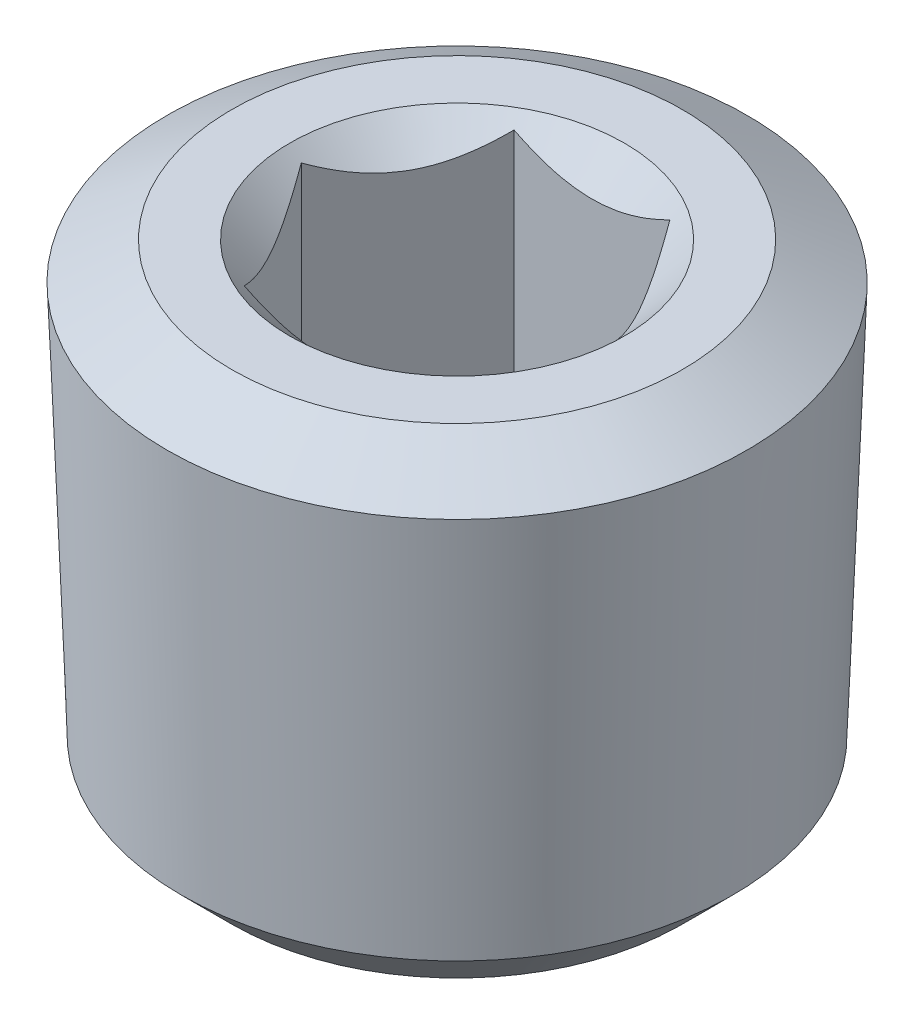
ISO-10303-21;
HEADER;
FILE_DESCRIPTION(('STEP AP214'),'2;1');
FILE_NAME('part.step','',(''),(''),'','','');
FILE_SCHEMA(('AUTOMOTIVE_DESIGN { 1 0 10303 214 1 1 1 1 }'));
ENDSEC;
DATA;
#1=APPLICATION_CONTEXT('core data for automotive mechanical design processes');
#2=APPLICATION_PROTOCOL_DEFINITION('international standard','automotive_design',2000,#1);
#3=PRODUCT_CONTEXT('',#1,'mechanical');
#4=PRODUCT('Part','Part','',(#3));
#5=PRODUCT_RELATED_PRODUCT_CATEGORY('part','',(#4));
#6=PRODUCT_DEFINITION_FORMATION('','',#4);
#7=PRODUCT_DEFINITION_CONTEXT('part definition',#1,'design');
#8=PRODUCT_DEFINITION('design','',#6,#7);
#9=PRODUCT_DEFINITION_SHAPE('','',#8);
#10=(LENGTH_UNIT() NAMED_UNIT(*) SI_UNIT(.MILLI.,.METRE.));
#11=(NAMED_UNIT(*) PLANE_ANGLE_UNIT() SI_UNIT($,.RADIAN.));
#12=(NAMED_UNIT(*) SI_UNIT($,.STERADIAN.) SOLID_ANGLE_UNIT());
#13=UNCERTAINTY_MEASURE_WITH_UNIT(LENGTH_MEASURE(1.E-05),#10,'distance_accuracy_value','');
#14=(GEOMETRIC_REPRESENTATION_CONTEXT(3) GLOBAL_UNCERTAINTY_ASSIGNED_CONTEXT((#13)) GLOBAL_UNIT_ASSIGNED_CONTEXT((#10,
#11,#12)) REPRESENTATION_CONTEXT('',''));
#15=CARTESIAN_POINT('',(0.,0.,0.));
#16=DIRECTION('',(0.,0.,1.));
#17=DIRECTION('',(1.,0.,0.));
#18=AXIS2_PLACEMENT_3D('',#15,#16,#17);
#19=CARTESIAN_POINT('',(0.,0.,0.));
#20=DIRECTION('',(0.,1.,0.));
#21=DIRECTION('',(0.,0.,1.));
#22=AXIS2_PLACEMENT_3D('',#19,#20,#21);
#23=PLANE('',#22);
#24=CARTESIAN_POINT('',(0.,0.,0.));
#25=DIRECTION('',(0.,1.,0.));
#26=DIRECTION('',(0.,0.,1.));
#27=AXIS2_PLACEMENT_3D('',#24,#25,#26);
#28=CIRCLE('',#27,3.937);
#29=CARTESIAN_POINT('',(0.,0.,3.937));
#30=VERTEX_POINT('',#29);
#31=EDGE_CURVE('E247',#30,#30,#28,.T.);
#32=ORIENTED_EDGE('',*,*,#31,.F.);
#33=EDGE_LOOP('',(#32));
#34=FACE_BOUND('',#33,.T.);
#35=CARTESIAN_POINT('',(0.,0.,0.));
#36=DIRECTION('',(0.,1.,0.));
#37=DIRECTION('',(0.,0.,1.));
#38=AXIS2_PLACEMENT_3D('',#35,#36,#37);
#39=CIRCLE('',#38,5.30290826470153);
#40=CARTESIAN_POINT('',(0.,0.,5.30290826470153));
#41=VERTEX_POINT('',#40);
#42=EDGE_CURVE('E12',#41,#41,#39,.T.);
#43=ORIENTED_EDGE('',*,*,#42,.T.);
#44=EDGE_LOOP('',(#43));
#45=FACE_BOUND('',#44,.T.);
#46=ADVANCED_FACE('F34',(#34,#45),#23,.T.);
#47=CARTESIAN_POINT('',(0.,0.,0.));
#48=DIRECTION('',(0.,-1.,0.));
#49=DIRECTION('',(0.,0.,-1.));
#50=AXIS2_PLACEMENT_3D('',#47,#48,#49);
#51=CONICAL_SURFACE('',#50,5.30290826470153,1.0471975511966);
#52=CARTESIAN_POINT('',(0.,-0.879323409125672,0.));
#53=DIRECTION('',(0.,1.,0.));
#54=DIRECTION('',(0.,0.,1.));
#55=AXIS2_PLACEMENT_3D('',#52,#53,#54);
#56=CIRCLE('',#55,6.82594108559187);
#57=CARTESIAN_POINT('',(0.,-0.879323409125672,6.82594108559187));
#58=VERTEX_POINT('',#57);
#59=EDGE_CURVE('E41',#58,#58,#56,.T.);
#60=ORIENTED_EDGE('',*,*,#59,.T.);
#61=EDGE_LOOP('',(#60));
#62=FACE_BOUND('',#61,.T.);
#63=ORIENTED_EDGE('',*,*,#42,.F.);
#64=EDGE_LOOP('',(#63));
#65=FACE_BOUND('',#64,.T.);
#66=ADVANCED_FACE('F237',(#62,#65),#51,.T.);
#67=CARTESIAN_POINT('',(0.,-0.879323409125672,0.));
#68=DIRECTION('',(0.,1.,0.));
#69=DIRECTION('',(0.,0.,1.));
#70=AXIS2_PLACEMENT_3D('',#67,#68,#69);
#71=CONICAL_SURFACE('',#70,6.82594108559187,0.0364424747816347);
#72=CARTESIAN_POINT('',(0.,-10.1167510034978,0.));
#73=DIRECTION('',(0.,1.,0.));
#74=DIRECTION('',(0.,0.,1.));
#75=AXIS2_PLACEMENT_3D('',#72,#73,#74);
#76=CIRCLE('',#75,6.48915726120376);
#77=CARTESIAN_POINT('',(0.,-10.1167510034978,6.48915726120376));
#78=VERTEX_POINT('',#77);
#79=EDGE_CURVE('E255',#78,#78,#76,.T.);
#80=ORIENTED_EDGE('',*,*,#79,.T.);
#81=EDGE_LOOP('',(#80));
#82=FACE_BOUND('',#81,.T.);
#83=ORIENTED_EDGE('',*,*,#59,.F.);
#84=EDGE_LOOP('',(#83));
#85=FACE_BOUND('',#84,.T.);
#86=ADVANCED_FACE('F242',(#82,#85),#71,.T.);
#87=CARTESIAN_POINT('',(0.,-10.1167510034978,0.));
#88=DIRECTION('',(0.,1.,0.));
#89=DIRECTION('',(0.,0.,1.));
#90=AXIS2_PLACEMENT_3D('',#87,#88,#89);
#91=CONICAL_SURFACE('',#90,6.48915726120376,0.785398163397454);
#92=CARTESIAN_POINT('',(0.,-11.303,0.));
#93=DIRECTION('',(0.,1.,0.));
#94=DIRECTION('',(0.,0.,1.));
#95=AXIS2_PLACEMENT_3D('',#92,#93,#94);
#96=CIRCLE('',#95,5.30290826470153);
#97=CARTESIAN_POINT('',(0.,-11.303,5.30290826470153));
#98=VERTEX_POINT('',#97);
#99=EDGE_CURVE('E251',#98,#98,#96,.T.);
#100=ORIENTED_EDGE('',*,*,#99,.T.);
#101=EDGE_LOOP('',(#100));
#102=FACE_BOUND('',#101,.T.);
#103=ORIENTED_EDGE('',*,*,#79,.F.);
#104=EDGE_LOOP('',(#103));
#105=FACE_BOUND('',#104,.T.);
#106=ADVANCED_FACE('F265',(#102,#105),#91,.T.);
#107=CARTESIAN_POINT('',(-5.30290826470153,-11.303,0.));
#108=DIRECTION('',(0.,-1.,0.));
#109=DIRECTION('',(0.,0.,-1.));
#110=AXIS2_PLACEMENT_3D('',#107,#108,#109);
#111=PLANE('',#110);
#112=ORIENTED_EDGE('',*,*,#99,.F.);
#113=EDGE_LOOP('',(#112));
#114=FACE_BOUND('',#113,.T.);
#115=ADVANCED_FACE('F181',(#114),#111,.T.);
#116=CARTESIAN_POINT('',(0.,0.,0.));
#117=DIRECTION('',(0.,1.,0.));
#118=DIRECTION('',(0.,0.,1.));
#119=AXIS2_PLACEMENT_3D('',#116,#117,#118);
#120=CONICAL_SURFACE('',#119,3.937,0.785398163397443);
#121=CARTESIAN_POINT('',(-3.93571910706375,1.11972916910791,3.175));
#122=CARTESIAN_POINT('',(-3.84104338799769,1.04605819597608,3.175));
#123=CARTESIAN_POINT('',(-3.7458702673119,0.973016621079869,3.175));
#124=CARTESIAN_POINT('',(-3.55432152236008,0.828483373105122,3.175));
#125=CARTESIAN_POINT('',(-3.45794562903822,0.756992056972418,3.175));
#126=CARTESIAN_POINT('',(-3.26308115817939,0.615342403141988,3.175));
#127=CARTESIAN_POINT('',(-3.1645820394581,0.54519852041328,3.175));
#128=CARTESIAN_POINT('',(-2.96596703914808,0.407246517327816,3.175));
#129=CARTESIAN_POINT('',(-2.86585126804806,0.339438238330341,3.175));
#130=CARTESIAN_POINT('',(-2.6568963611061,0.20221469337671,3.175));
#131=CARTESIAN_POINT('',(-2.5479247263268,0.133000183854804,3.175));
#132=CARTESIAN_POINT('',(-2.32741654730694,-0.00128644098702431,3.175));
#133=CARTESIAN_POINT('',(-2.21587956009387,-0.0663578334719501,3.175));
#134=CARTESIAN_POINT('',(-1.99018437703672,-0.190984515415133,3.175));
#135=CARTESIAN_POINT('',(-1.87603517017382,-0.250555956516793,3.175));
#136=CARTESIAN_POINT('',(-1.64444175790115,-0.362847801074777,3.175));
#137=CARTESIAN_POINT('',(-1.52699917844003,-0.415571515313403,3.175));
#138=CARTESIAN_POINT('',(-1.30155237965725,-0.506949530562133,3.175));
#139=CARTESIAN_POINT('',(-1.1939199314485,-0.546511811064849,3.175));
#140=CARTESIAN_POINT('',(-0.975818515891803,-0.617028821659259,3.175));
#141=CARTESIAN_POINT('',(-0.865349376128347,-0.647983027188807,3.175));
#142=CARTESIAN_POINT('',(-0.64421673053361,-0.699051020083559,3.175));
#143=CARTESIAN_POINT('',(-0.533601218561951,-0.719369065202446,3.175));
#144=CARTESIAN_POINT('',(-0.310874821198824,-0.748724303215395,3.175));
#145=CARTESIAN_POINT('',(-0.198764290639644,-0.757764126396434,3.175));
#146=CARTESIAN_POINT('',(0.0202799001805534,-0.763730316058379,3.175));
#147=CARTESIAN_POINT('',(0.127198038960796,-0.761228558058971,3.175));
#148=CARTESIAN_POINT('',(0.340248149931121,-0.745589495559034,3.175));
#149=CARTESIAN_POINT('',(0.446380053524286,-0.732451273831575,3.175));
#150=CARTESIAN_POINT('',(0.658892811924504,-0.696075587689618,3.175));
#151=CARTESIAN_POINT('',(0.765241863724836,-0.672655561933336,3.175));
#152=CARTESIAN_POINT('',(0.975578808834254,-0.617048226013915,3.175));
#153=CARTESIAN_POINT('',(1.07956679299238,-0.584861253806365,3.175));
#154=CARTESIAN_POINT('',(1.28885040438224,-0.511832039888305,3.175));
#155=CARTESIAN_POINT('',(1.39404662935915,-0.470708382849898,3.175));
#156=CARTESIAN_POINT('',(1.60173093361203,-0.382096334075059,3.175));
#157=CARTESIAN_POINT('',(1.70421815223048,-0.334605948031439,3.175));
#158=CARTESIAN_POINT('',(1.90698237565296,-0.234377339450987,3.175));
#159=CARTESIAN_POINT('',(2.0072512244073,-0.181622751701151,3.175));
#160=CARTESIAN_POINT('',(2.20549346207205,-0.0720283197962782,3.175));
#161=CARTESIAN_POINT('',(2.30346724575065,-0.0151891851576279,3.175));
#162=CARTESIAN_POINT('',(2.49264239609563,0.0988994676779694,3.175));
#163=CARTESIAN_POINT('',(2.58393963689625,0.155990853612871,3.175));
#164=CARTESIAN_POINT('',(2.76496520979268,0.272616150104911,3.175));
#165=CARTESIAN_POINT('',(2.85469342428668,0.332150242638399,3.175));
#166=CARTESIAN_POINT('',(3.03206818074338,0.452744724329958,3.175));
#167=CARTESIAN_POINT('',(3.11972562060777,0.513789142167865,3.175));
#168=CARTESIAN_POINT('',(3.29383610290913,0.637523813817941,3.175));
#169=CARTESIAN_POINT('',(3.38028947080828,0.700213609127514,3.175));
#170=CARTESIAN_POINT('',(3.46623735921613,0.763577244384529,3.175));
#171=B_SPLINE_CURVE_WITH_KNOTS('',3,(#121,#122,#123,#124,#125,#126,#127,#128,#129,#130,#131,
#132,#133,#134,#135,#136,#137,#138,#139,#140,#141,#142,#143,#144,#145,#146,#147,#148,#149,#150,
#151,#152,#153,#154,#155,#156,#157,#158,#159,#160,#161,#162,#163,#164,#165,#166,#167,#168,#169,
#170),.UNSPECIFIED.,.F.,.F.,(4,2,2,2,2,2,2,2,2,2,2,2,2,2,2,2,2,2,2,2,2,2,2,2,4),(0.,
0.359892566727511,0.719867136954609,1.08260645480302,1.44532108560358,1.83253224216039,
2.21981077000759,2.60591317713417,2.99182820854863,3.33555423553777,3.67930120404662,
4.01617928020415,4.35297877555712,4.67327447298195,4.99359779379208,5.31985449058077,
5.64609861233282,5.98468714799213,6.32338199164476,6.66316466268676,7.00288845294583,
7.3258777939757,7.64889124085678,7.96932699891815,8.28967439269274),.UNSPECIFIED.);
#172=CARTESIAN_POINT('',(1.83308710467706,-0.27082579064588,3.175));
#173=VERTEX_POINT('',#172);
#174=CARTESIAN_POINT('',(-1.83308710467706,-0.27082579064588,3.175));
#175=VERTEX_POINT('',#174);
#176=EDGE_CURVE('E48',#173,#175,#171,.F.);
#177=ORIENTED_EDGE('',*,*,#176,.T.);
#178=CARTESIAN_POINT('',(-1.83297163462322,-0.270710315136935,3.1752));
#179=CARTESIAN_POINT('',(-1.89598269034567,-0.333666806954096,3.06606165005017));
#180=CARTESIAN_POINT('',(-1.9600473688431,-0.392925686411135,2.95509837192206));
#181=CARTESIAN_POINT('',(-2.09068223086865,-0.501427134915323,2.72883215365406));
#182=CARTESIAN_POINT('',(-2.15726483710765,-0.550609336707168,2.61350769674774));
#183=CARTESIAN_POINT('',(-2.29152545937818,-0.634859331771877,2.38096147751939));
#184=CARTESIAN_POINT('',(-2.35916928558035,-0.670138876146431,2.26379893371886));
#185=CARTESIAN_POINT('',(-2.49594609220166,-0.724494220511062,2.02689455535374));
#186=CARTESIAN_POINT('',(-2.56507489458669,-0.743610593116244,1.90715995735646));
#187=CARTESIAN_POINT('',(-2.68421566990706,-0.760858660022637,1.70080208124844));
#188=CARTESIAN_POINT('',(-2.73407378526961,-0.763411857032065,1.61444529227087));
#189=CARTESIAN_POINT('',(-2.83370891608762,-0.759109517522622,1.44187218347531));
#190=CARTESIAN_POINT('',(-2.88348589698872,-0.752250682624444,1.35565592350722));
#191=CARTESIAN_POINT('',(-2.98256827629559,-0.72951590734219,1.1840402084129));
#192=CARTESIAN_POINT('',(-3.03187308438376,-0.713629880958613,1.09864177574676));
#193=CARTESIAN_POINT('',(-3.12963590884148,-0.673707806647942,0.929311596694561));
#194=CARTESIAN_POINT('',(-3.17809398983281,-0.649672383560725,0.845379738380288));
#195=CARTESIAN_POINT('',(-3.26412109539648,-0.60022055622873,0.696376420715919));
#196=CARTESIAN_POINT('',(-3.30188053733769,-0.576104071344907,0.630975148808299));
#197=CARTESIAN_POINT('',(-3.37672152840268,-0.523984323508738,0.501346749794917));
#198=CARTESIAN_POINT('',(-3.41380305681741,-0.495980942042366,0.437119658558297));
#199=CARTESIAN_POINT('',(-3.48717139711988,-0.436715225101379,0.310041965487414));
#200=CARTESIAN_POINT('',(-3.52346029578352,-0.405463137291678,0.247187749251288));
#201=CARTESIAN_POINT('',(-3.59536602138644,-0.34011044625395,0.122643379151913));
#202=CARTESIAN_POINT('',(-3.63098324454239,-0.306011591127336,0.060952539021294));
#203=CARTESIAN_POINT('',(-3.66628967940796,-0.270710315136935,-0.000199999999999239));
#204=B_SPLINE_CURVE_WITH_KNOTS('',3,(#178,#179,#180,#181,#182,#183,#184,#185,#186,#187,#188,
#189,#190,#191,#192,#193,#194,#195,#196,#197,#198,#199,#200,#201,#202,#203),.UNSPECIFIED.,.F.,
.F.,(4,2,2,2,2,2,2,2,2,2,2,2,4),(0.,0.422910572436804,0.848285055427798,1.26690402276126,
1.68446903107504,1.98329272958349,2.28222117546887,2.58148426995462,2.88072442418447,
3.11844134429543,3.35616551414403,3.59316134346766,3.8300126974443),.UNSPECIFIED.);
#205=CARTESIAN_POINT('',(-3.66617420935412,-0.270825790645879,0.));
#206=VERTEX_POINT('',#205);
#207=EDGE_CURVE('E123',#175,#206,#204,.T.);
#208=ORIENTED_EDGE('',*,*,#207,.T.);
#209=CARTESIAN_POINT('',(-3.66628967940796,-0.270710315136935,0.000200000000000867));
#210=CARTESIAN_POINT('',(-3.60327862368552,-0.333666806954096,-0.108938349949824));
#211=CARTESIAN_POINT('',(-3.53921394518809,-0.392925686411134,-0.219901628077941));
#212=CARTESIAN_POINT('',(-3.40857908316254,-0.501427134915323,-0.446167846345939));
#213=CARTESIAN_POINT('',(-3.34199647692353,-0.550609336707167,-0.561492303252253));
#214=CARTESIAN_POINT('',(-3.20773585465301,-0.634859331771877,-0.794038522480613));
#215=CARTESIAN_POINT('',(-3.14009202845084,-0.670138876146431,-0.911201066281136));
#216=CARTESIAN_POINT('',(-3.00331522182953,-0.724494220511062,-1.14810544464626));
#217=CARTESIAN_POINT('',(-2.93418641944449,-0.743610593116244,-1.26784004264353));
#218=CARTESIAN_POINT('',(-2.81504564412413,-0.760858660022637,-1.47419791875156));
#219=CARTESIAN_POINT('',(-2.76518752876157,-0.763411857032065,-1.56055470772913));
#220=CARTESIAN_POINT('',(-2.66555239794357,-0.759109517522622,-1.73312781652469));
#221=CARTESIAN_POINT('',(-2.61577541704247,-0.752250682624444,-1.81934407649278));
#222=CARTESIAN_POINT('',(-2.51669303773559,-0.72951590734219,-1.9909597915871));
#223=CARTESIAN_POINT('',(-2.46738822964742,-0.713629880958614,-2.07635822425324));
#224=CARTESIAN_POINT('',(-2.36962540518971,-0.673707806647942,-2.24568840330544));
#225=CARTESIAN_POINT('',(-2.32116732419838,-0.649672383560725,-2.32962026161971));
#226=CARTESIAN_POINT('',(-2.23514021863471,-0.600220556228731,-2.47862357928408));
#227=CARTESIAN_POINT('',(-2.1973807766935,-0.576104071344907,-2.5440248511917));
#228=CARTESIAN_POINT('',(-2.1225397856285,-0.523984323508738,-2.67365325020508));
#229=CARTESIAN_POINT('',(-2.08545825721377,-0.495980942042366,-2.7378803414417));
#230=CARTESIAN_POINT('',(-2.0120899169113,-0.436715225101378,-2.86495803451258));
#231=CARTESIAN_POINT('',(-1.97580101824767,-0.405463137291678,-2.92781225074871));
#232=CARTESIAN_POINT('',(-1.90389529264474,-0.34011044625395,-3.05235662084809));
#233=CARTESIAN_POINT('',(-1.8682780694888,-0.306011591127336,-3.11404746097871));
#234=CARTESIAN_POINT('',(-1.83297163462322,-0.270710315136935,-3.1752));
#235=B_SPLINE_CURVE_WITH_KNOTS('',3,(#209,#210,#211,#212,#213,#214,#215,#216,#217,#218,#219,
#220,#221,#222,#223,#224,#225,#226,#227,#228,#229,#230,#231,#232,#233,#234),.UNSPECIFIED.,.F.,
.F.,(4,2,2,2,2,2,2,2,2,2,2,2,4),(0.,0.422910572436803,0.848285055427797,1.26690402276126,
1.68446903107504,1.98329272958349,2.28222117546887,2.58148426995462,2.88072442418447,
3.11844134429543,3.35616551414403,3.59316134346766,3.8300126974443),.UNSPECIFIED.);
#236=CARTESIAN_POINT('',(-1.83308710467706,-0.270825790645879,-3.175));
#237=VERTEX_POINT('',#236);
#238=EDGE_CURVE('E204',#206,#237,#235,.T.);
#239=ORIENTED_EDGE('',*,*,#238,.T.);
#240=CARTESIAN_POINT('',(-3.93571910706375,1.11972916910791,-3.175));
#241=CARTESIAN_POINT('',(-3.84104338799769,1.04605819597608,-3.175));
#242=CARTESIAN_POINT('',(-3.7458702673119,0.973016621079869,-3.175));
#243=CARTESIAN_POINT('',(-3.55432152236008,0.828483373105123,-3.175));
#244=CARTESIAN_POINT('',(-3.45794562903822,0.756992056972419,-3.175));
#245=CARTESIAN_POINT('',(-3.26308115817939,0.615342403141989,-3.175));
#246=CARTESIAN_POINT('',(-3.1645820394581,0.545198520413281,-3.175));
#247=CARTESIAN_POINT('',(-2.96596703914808,0.407246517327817,-3.175));
#248=CARTESIAN_POINT('',(-2.86585126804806,0.339438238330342,-3.175));
#249=CARTESIAN_POINT('',(-2.6568963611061,0.20221469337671,-3.175));
#250=CARTESIAN_POINT('',(-2.54792472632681,0.133000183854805,-3.175));
#251=CARTESIAN_POINT('',(-2.32741654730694,-0.00128644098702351,-3.175));
#252=CARTESIAN_POINT('',(-2.21587956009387,-0.0663578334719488,-3.175));
#253=CARTESIAN_POINT('',(-1.99018437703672,-0.190984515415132,-3.175));
#254=CARTESIAN_POINT('',(-1.87603517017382,-0.250555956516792,-3.175));
#255=CARTESIAN_POINT('',(-1.64444175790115,-0.362847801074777,-3.175));
#256=CARTESIAN_POINT('',(-1.52699917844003,-0.415571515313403,-3.175));
#257=CARTESIAN_POINT('',(-1.30155237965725,-0.506949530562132,-3.175));
#258=CARTESIAN_POINT('',(-1.1939199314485,-0.546511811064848,-3.175));
#259=CARTESIAN_POINT('',(-0.975818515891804,-0.617028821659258,-3.175));
#260=CARTESIAN_POINT('',(-0.865349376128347,-0.647983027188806,-3.175));
#261=CARTESIAN_POINT('',(-0.64421673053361,-0.699051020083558,-3.175));
#262=CARTESIAN_POINT('',(-0.533601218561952,-0.719369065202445,-3.175));
#263=CARTESIAN_POINT('',(-0.310874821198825,-0.748724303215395,-3.175));
#264=CARTESIAN_POINT('',(-0.198764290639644,-0.757764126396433,-3.175));
#265=CARTESIAN_POINT('',(0.020279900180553,-0.763730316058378,-3.175));
#266=CARTESIAN_POINT('',(0.127198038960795,-0.76122855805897,-3.175));
#267=CARTESIAN_POINT('',(0.34024814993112,-0.745589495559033,-3.175));
#268=CARTESIAN_POINT('',(0.446380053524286,-0.732451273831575,-3.175));
#269=CARTESIAN_POINT('',(0.658892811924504,-0.696075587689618,-3.175));
#270=CARTESIAN_POINT('',(0.765241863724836,-0.672655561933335,-3.175));
#271=CARTESIAN_POINT('',(0.975578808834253,-0.617048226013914,-3.175));
#272=CARTESIAN_POINT('',(1.07956679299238,-0.584861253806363,-3.175));
#273=CARTESIAN_POINT('',(1.28885040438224,-0.511832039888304,-3.175));
#274=CARTESIAN_POINT('',(1.39404662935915,-0.470708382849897,-3.175));
#275=CARTESIAN_POINT('',(1.60173093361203,-0.382096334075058,-3.175));
#276=CARTESIAN_POINT('',(1.70421815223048,-0.334605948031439,-3.175));
#277=CARTESIAN_POINT('',(1.90698237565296,-0.234377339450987,-3.175));
#278=CARTESIAN_POINT('',(2.0072512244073,-0.181622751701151,-3.175));
#279=CARTESIAN_POINT('',(2.20549346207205,-0.0720283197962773,-3.175));
#280=CARTESIAN_POINT('',(2.30346724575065,-0.0151891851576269,-3.175));
#281=CARTESIAN_POINT('',(2.49264239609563,0.0988994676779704,-3.175));
#282=CARTESIAN_POINT('',(2.58393963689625,0.155990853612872,-3.175));
#283=CARTESIAN_POINT('',(2.76496520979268,0.272616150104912,-3.175));
#284=CARTESIAN_POINT('',(2.85469342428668,0.3321502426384,-3.175));
#285=CARTESIAN_POINT('',(3.03206818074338,0.452744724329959,-3.175));
#286=CARTESIAN_POINT('',(3.11972562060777,0.513789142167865,-3.175));
#287=CARTESIAN_POINT('',(3.29383610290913,0.637523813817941,-3.175));
#288=CARTESIAN_POINT('',(3.38028947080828,0.700213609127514,-3.175));
#289=CARTESIAN_POINT('',(3.46623735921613,0.76357724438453,-3.175));
#290=B_SPLINE_CURVE_WITH_KNOTS('',3,(#240,#241,#242,#243,#244,#245,#246,#247,#248,#249,#250,
#251,#252,#253,#254,#255,#256,#257,#258,#259,#260,#261,#262,#263,#264,#265,#266,#267,#268,#269,
#270,#271,#272,#273,#274,#275,#276,#277,#278,#279,#280,#281,#282,#283,#284,#285,#286,#287,#288,
#289),.UNSPECIFIED.,.F.,.F.,(4,2,2,2,2,2,2,2,2,2,2,2,2,2,2,2,2,2,2,2,2,2,2,2,4),(0.,
0.35989256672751,0.719867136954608,1.08260645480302,1.44532108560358,1.83253224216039,
2.21981077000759,2.60591317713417,2.99182820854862,3.33555423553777,3.67930120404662,
4.01617928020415,4.35297877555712,4.67327447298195,4.99359779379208,5.31985449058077,
5.64609861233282,5.98468714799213,6.32338199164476,6.66316466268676,7.00288845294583,
7.3258777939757,7.64889124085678,7.96932699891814,8.28967439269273),.UNSPECIFIED.);
#291=CARTESIAN_POINT('',(1.83308710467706,-0.27082579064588,-3.175));
#292=VERTEX_POINT('',#291);
#293=EDGE_CURVE('E197',#237,#292,#290,.T.);
#294=ORIENTED_EDGE('',*,*,#293,.T.);
#295=CARTESIAN_POINT('',(1.83297163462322,-0.270710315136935,-3.1752));
#296=CARTESIAN_POINT('',(1.89598269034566,-0.333666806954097,-3.06606165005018));
#297=CARTESIAN_POINT('',(1.9600473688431,-0.392925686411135,-2.95509837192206));
#298=CARTESIAN_POINT('',(2.09068223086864,-0.501427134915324,-2.72883215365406));
#299=CARTESIAN_POINT('',(2.15726483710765,-0.550609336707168,-2.61350769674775));
#300=CARTESIAN_POINT('',(2.29152545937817,-0.634859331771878,-2.38096147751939));
#301=CARTESIAN_POINT('',(2.35916928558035,-0.670138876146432,-2.26379893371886));
#302=CARTESIAN_POINT('',(2.49594609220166,-0.724494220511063,-2.02689455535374));
#303=CARTESIAN_POINT('',(2.56507489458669,-0.743610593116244,-1.90715995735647));
#304=CARTESIAN_POINT('',(2.68421566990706,-0.760858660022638,-1.70080208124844));
#305=CARTESIAN_POINT('',(2.73407378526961,-0.763411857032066,-1.61444529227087));
#306=CARTESIAN_POINT('',(2.83370891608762,-0.759109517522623,-1.44187218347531));
#307=CARTESIAN_POINT('',(2.88348589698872,-0.752250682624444,-1.35565592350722));
#308=CARTESIAN_POINT('',(2.98256827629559,-0.729515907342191,-1.1840402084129));
#309=CARTESIAN_POINT('',(3.03187308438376,-0.713629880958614,-1.09864177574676));
#310=CARTESIAN_POINT('',(3.12963590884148,-0.673707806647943,-0.929311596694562));
#311=CARTESIAN_POINT('',(3.17809398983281,-0.649672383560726,-0.845379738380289));
#312=CARTESIAN_POINT('',(3.26412109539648,-0.600220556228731,-0.696376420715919));
#313=CARTESIAN_POINT('',(3.30188053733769,-0.576104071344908,-0.630975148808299));
#314=CARTESIAN_POINT('',(3.37672152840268,-0.523984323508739,-0.501346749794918));
#315=CARTESIAN_POINT('',(3.41380305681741,-0.495980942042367,-0.437119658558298));
#316=CARTESIAN_POINT('',(3.48717139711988,-0.43671522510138,-0.310041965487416));
#317=CARTESIAN_POINT('',(3.52346029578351,-0.405463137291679,-0.247187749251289));
#318=CARTESIAN_POINT('',(3.59536602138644,-0.340110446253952,-0.122643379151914));
#319=CARTESIAN_POINT('',(3.63098324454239,-0.306011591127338,-0.0609525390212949));
#320=CARTESIAN_POINT('',(3.66628967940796,-0.270710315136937,0.000199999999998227));
#321=B_SPLINE_CURVE_WITH_KNOTS('',3,(#295,#296,#297,#298,#299,#300,#301,#302,#303,#304,#305,
#306,#307,#308,#309,#310,#311,#312,#313,#314,#315,#316,#317,#318,#319,#320),.UNSPECIFIED.,.F.,
.F.,(4,2,2,2,2,2,2,2,2,2,2,2,4),(0.,0.422910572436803,0.848285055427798,1.26690402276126,
1.68446903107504,1.98329272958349,2.28222117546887,2.58148426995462,2.88072442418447,
3.11844134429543,3.35616551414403,3.59316134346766,3.8300126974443),.UNSPECIFIED.);
#322=CARTESIAN_POINT('',(3.66617420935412,-0.270825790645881,0.));
#323=VERTEX_POINT('',#322);
#324=EDGE_CURVE('E190',#292,#323,#321,.T.);
#325=ORIENTED_EDGE('',*,*,#324,.T.);
#326=CARTESIAN_POINT('',(3.66628967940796,-0.270710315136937,-0.000200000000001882));
#327=CARTESIAN_POINT('',(3.60327862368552,-0.333666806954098,0.108938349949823));
#328=CARTESIAN_POINT('',(3.53921394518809,-0.392925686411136,0.219901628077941));
#329=CARTESIAN_POINT('',(3.40857908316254,-0.501427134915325,0.446167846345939));
#330=CARTESIAN_POINT('',(3.34199647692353,-0.550609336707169,0.561492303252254));
#331=CARTESIAN_POINT('',(3.20773585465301,-0.634859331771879,0.794038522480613));
#332=CARTESIAN_POINT('',(3.14009202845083,-0.670138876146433,0.911201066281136));
#333=CARTESIAN_POINT('',(3.00331522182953,-0.724494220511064,1.14810544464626));
#334=CARTESIAN_POINT('',(2.93418641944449,-0.743610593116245,1.26784004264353));
#335=CARTESIAN_POINT('',(2.81504564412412,-0.760858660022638,1.47419791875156));
#336=CARTESIAN_POINT('',(2.76518752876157,-0.763411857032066,1.56055470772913));
#337=CARTESIAN_POINT('',(2.66555239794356,-0.759109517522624,1.73312781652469));
#338=CARTESIAN_POINT('',(2.61577541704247,-0.752250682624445,1.81934407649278));
#339=CARTESIAN_POINT('',(2.51669303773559,-0.729515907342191,1.9909597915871));
#340=CARTESIAN_POINT('',(2.46738822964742,-0.713629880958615,2.07635822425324));
#341=CARTESIAN_POINT('',(2.36962540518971,-0.673707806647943,2.24568840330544));
#342=CARTESIAN_POINT('',(2.32116732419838,-0.649672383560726,2.32962026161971));
#343=CARTESIAN_POINT('',(2.2351402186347,-0.600220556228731,2.47862357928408));
#344=CARTESIAN_POINT('',(2.1973807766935,-0.576104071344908,2.5440248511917));
#345=CARTESIAN_POINT('',(2.1225397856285,-0.523984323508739,2.67365325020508));
#346=CARTESIAN_POINT('',(2.08545825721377,-0.495980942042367,2.7378803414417));
#347=CARTESIAN_POINT('',(2.0120899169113,-0.43671522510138,2.86495803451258));
#348=CARTESIAN_POINT('',(1.97580101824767,-0.405463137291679,2.92781225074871));
#349=CARTESIAN_POINT('',(1.90389529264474,-0.340110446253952,3.05235662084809));
#350=CARTESIAN_POINT('',(1.8682780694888,-0.306011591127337,3.11404746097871));
#351=CARTESIAN_POINT('',(1.83297163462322,-0.270710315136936,3.1752));
#352=B_SPLINE_CURVE_WITH_KNOTS('',3,(#326,#327,#328,#329,#330,#331,#332,#333,#334,#335,#336,
#337,#338,#339,#340,#341,#342,#343,#344,#345,#346,#347,#348,#349,#350,#351),.UNSPECIFIED.,.F.,
.F.,(4,2,2,2,2,2,2,2,2,2,2,2,4),(0.,0.422910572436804,0.848285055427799,1.26690402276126,
1.68446903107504,1.98329272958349,2.28222117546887,2.58148426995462,2.88072442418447,
3.11844134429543,3.35616551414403,3.59316134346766,3.8300126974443),.UNSPECIFIED.);
#353=EDGE_CURVE('E167',#323,#173,#352,.T.);
#354=ORIENTED_EDGE('',*,*,#353,.T.);
#355=EDGE_LOOP('',(#177,#208,#239,#294,#325,#354));
#356=FACE_BOUND('',#355,.T.);
#357=ORIENTED_EDGE('',*,*,#31,.T.);
#358=EDGE_LOOP('',(#357));
#359=FACE_BOUND('',#358,.T.);
#360=ADVANCED_FACE('F176',(#356,#359),#120,.F.);
#361=CARTESIAN_POINT('',(-3.66617420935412,-6.35,0.));
#362=DIRECTION('',(-0.866025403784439,0.,0.5));
#363=DIRECTION('',(0.5,0.,0.866025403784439));
#364=AXIS2_PLACEMENT_3D('',#361,#362,#363);
#365=PLANE('',#364);
#366=DIRECTION('',(0.,1.,0.));
#367=VECTOR('',#366,1.);
#368=CARTESIAN_POINT('',(-1.83308710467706,-6.35,3.175));
#369=LINE('',#368,#367);
#370=CARTESIAN_POINT('',(-1.83308710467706,-6.35,3.175));
#371=VERTEX_POINT('',#370);
#372=EDGE_CURVE('E120',#371,#175,#369,.T.);
#373=ORIENTED_EDGE('',*,*,#372,.F.);
#374=DIRECTION('',(0.5,0.,0.866025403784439));
#375=VECTOR('',#374,1.);
#376=CARTESIAN_POINT('',(-3.66617420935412,-6.35,0.));
#377=LINE('',#376,#375);
#378=CARTESIAN_POINT('',(-2.74963065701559,-6.35,1.5875));
#379=VERTEX_POINT('',#378);
#380=EDGE_CURVE('E107',#379,#371,#377,.T.);
#381=ORIENTED_EDGE('',*,*,#380,.F.);
#382=CARTESIAN_POINT('',(-3.66617420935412,-6.35,0.));
#383=VERTEX_POINT('',#382);
#384=EDGE_CURVE('E117',#383,#379,#377,.T.);
#385=ORIENTED_EDGE('',*,*,#384,.F.);
#386=DIRECTION('',(0.,1.,0.));
#387=VECTOR('',#386,1.);
#388=CARTESIAN_POINT('',(-3.66617420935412,-6.35,0.));
#389=LINE('',#388,#387);
#390=EDGE_CURVE('E147',#383,#206,#389,.T.);
#391=ORIENTED_EDGE('',*,*,#390,.T.);
#392=ORIENTED_EDGE('',*,*,#207,.F.);
#393=EDGE_LOOP('',(#373,#381,#385,#391,#392));
#394=FACE_BOUND('',#393,.T.);
#395=ADVANCED_FACE('F121',(#394),#365,.F.);
#396=CARTESIAN_POINT('',(-1.83308710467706,-6.35,-3.175));
#397=DIRECTION('',(-0.866025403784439,0.,-0.5));
#398=DIRECTION('',(-0.5,0.,0.866025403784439));
#399=AXIS2_PLACEMENT_3D('',#396,#397,#398);
#400=PLANE('',#399);
#401=ORIENTED_EDGE('',*,*,#390,.F.);
#402=DIRECTION('',(-0.5,0.,0.866025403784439));
#403=VECTOR('',#402,1.);
#404=CARTESIAN_POINT('',(-1.83308710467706,-6.35,-3.175));
#405=LINE('',#404,#403);
#406=CARTESIAN_POINT('',(-2.74963065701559,-6.35,-1.5875));
#407=VERTEX_POINT('',#406);
#408=EDGE_CURVE('E144',#407,#383,#405,.T.);
#409=ORIENTED_EDGE('',*,*,#408,.F.);
#410=CARTESIAN_POINT('',(-1.83308710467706,-6.35,-3.175));
#411=VERTEX_POINT('',#410);
#412=EDGE_CURVE('E126',#411,#407,#405,.T.);
#413=ORIENTED_EDGE('',*,*,#412,.F.);
#414=DIRECTION('',(0.,1.,0.));
#415=VECTOR('',#414,1.);
#416=CARTESIAN_POINT('',(-1.83308710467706,-6.35,-3.175));
#417=LINE('',#416,#415);
#418=EDGE_CURVE('E149',#411,#237,#417,.T.);
#419=ORIENTED_EDGE('',*,*,#418,.T.);
#420=ORIENTED_EDGE('',*,*,#238,.F.);
#421=EDGE_LOOP('',(#401,#409,#413,#419,#420));
#422=FACE_BOUND('',#421,.T.);
#423=ADVANCED_FACE('F215',(#422),#400,.F.);
#424=CARTESIAN_POINT('',(1.83308710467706,-6.35,-3.175));
#425=DIRECTION('',(0.,0.,-1.));
#426=DIRECTION('',(-1.,0.,0.));
#427=AXIS2_PLACEMENT_3D('',#424,#425,#426);
#428=PLANE('',#427);
#429=ORIENTED_EDGE('',*,*,#418,.F.);
#430=DIRECTION('',(-1.,0.,0.));
#431=VECTOR('',#430,1.);
#432=CARTESIAN_POINT('',(1.83308710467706,-6.35,-3.175));
#433=LINE('',#432,#431);
#434=CARTESIAN_POINT('',(0.,-6.35,-3.175));
#435=VERTEX_POINT('',#434);
#436=EDGE_CURVE('E140',#435,#411,#433,.T.);
#437=ORIENTED_EDGE('',*,*,#436,.F.);
#438=CARTESIAN_POINT('',(1.83308710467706,-6.35,-3.175));
#439=VERTEX_POINT('',#438);
#440=EDGE_CURVE('E141',#439,#435,#433,.T.);
#441=ORIENTED_EDGE('',*,*,#440,.F.);
#442=DIRECTION('',(0.,1.,0.));
#443=VECTOR('',#442,1.);
#444=CARTESIAN_POINT('',(1.83308710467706,-6.35,-3.175));
#445=LINE('',#444,#443);
#446=EDGE_CURVE('E152',#439,#292,#445,.T.);
#447=ORIENTED_EDGE('',*,*,#446,.T.);
#448=ORIENTED_EDGE('',*,*,#293,.F.);
#449=EDGE_LOOP('',(#429,#437,#441,#447,#448));
#450=FACE_BOUND('',#449,.T.);
#451=ADVANCED_FACE('F219',(#450),#428,.F.);
#452=CARTESIAN_POINT('',(3.66617420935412,-6.35,0.));
#453=DIRECTION('',(0.866025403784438,0.,-0.5));
#454=DIRECTION('',(-0.5,0.,-0.866025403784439));
#455=AXIS2_PLACEMENT_3D('',#452,#453,#454);
#456=PLANE('',#455);
#457=ORIENTED_EDGE('',*,*,#446,.F.);
#458=DIRECTION('',(-0.5,0.,-0.866025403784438));
#459=VECTOR('',#458,1.);
#460=CARTESIAN_POINT('',(3.66617420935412,-6.35,0.));
#461=LINE('',#460,#459);
#462=CARTESIAN_POINT('',(2.74963065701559,-6.35,-1.5875));
#463=VERTEX_POINT('',#462);
#464=EDGE_CURVE('E136',#463,#439,#461,.T.);
#465=ORIENTED_EDGE('',*,*,#464,.F.);
#466=CARTESIAN_POINT('',(3.66617420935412,-6.35,0.));
#467=VERTEX_POINT('',#466);
#468=EDGE_CURVE('E137',#467,#463,#461,.T.);
#469=ORIENTED_EDGE('',*,*,#468,.F.);
#470=DIRECTION('',(0.,1.,0.));
#471=VECTOR('',#470,1.);
#472=CARTESIAN_POINT('',(3.66617420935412,-6.35,0.));
#473=LINE('',#472,#471);
#474=EDGE_CURVE('E155',#467,#323,#473,.T.);
#475=ORIENTED_EDGE('',*,*,#474,.T.);
#476=ORIENTED_EDGE('',*,*,#324,.F.);
#477=EDGE_LOOP('',(#457,#465,#469,#475,#476));
#478=FACE_BOUND('',#477,.T.);
#479=ADVANCED_FACE('F223',(#478),#456,.F.);
#480=CARTESIAN_POINT('',(1.83308710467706,-6.35,3.175));
#481=DIRECTION('',(0.866025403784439,0.,0.5));
#482=DIRECTION('',(0.5,0.,-0.866025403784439));
#483=AXIS2_PLACEMENT_3D('',#480,#481,#482);
#484=PLANE('',#483);
#485=ORIENTED_EDGE('',*,*,#474,.F.);
#486=DIRECTION('',(0.5,0.,-0.866025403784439));
#487=VECTOR('',#486,1.);
#488=CARTESIAN_POINT('',(1.83308710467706,-6.35,3.175));
#489=LINE('',#488,#487);
#490=CARTESIAN_POINT('',(2.74963065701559,-6.35,1.5875));
#491=VERTEX_POINT('',#490);
#492=EDGE_CURVE('E132',#491,#467,#489,.T.);
#493=ORIENTED_EDGE('',*,*,#492,.F.);
#494=CARTESIAN_POINT('',(1.83308710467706,-6.35,3.175));
#495=VERTEX_POINT('',#494);
#496=EDGE_CURVE('E56',#495,#491,#489,.T.);
#497=ORIENTED_EDGE('',*,*,#496,.F.);
#498=DIRECTION('',(0.,1.,0.));
#499=VECTOR('',#498,1.);
#500=CARTESIAN_POINT('',(1.83308710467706,-6.35,3.175));
#501=LINE('',#500,#499);
#502=EDGE_CURVE('E125',#495,#173,#501,.T.);
#503=ORIENTED_EDGE('',*,*,#502,.T.);
#504=ORIENTED_EDGE('',*,*,#353,.F.);
#505=EDGE_LOOP('',(#485,#493,#497,#503,#504));
#506=FACE_BOUND('',#505,.T.);
#507=ADVANCED_FACE('F227',(#506),#484,.F.);
#508=CARTESIAN_POINT('',(-1.83308710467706,-6.35,3.175));
#509=DIRECTION('',(0.,0.,1.));
#510=DIRECTION('',(1.,0.,0.));
#511=AXIS2_PLACEMENT_3D('',#508,#509,#510);
#512=PLANE('',#511);
#513=ORIENTED_EDGE('',*,*,#502,.F.);
#514=DIRECTION('',(1.,0.,0.));
#515=VECTOR('',#514,1.);
#516=CARTESIAN_POINT('',(-1.83308710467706,-6.35,3.175));
#517=LINE('',#516,#515);
#518=CARTESIAN_POINT('',(0.,-6.35,3.175));
#519=VERTEX_POINT('',#518);
#520=EDGE_CURVE('E131',#519,#495,#517,.T.);
#521=ORIENTED_EDGE('',*,*,#520,.F.);
#522=EDGE_CURVE('E111',#371,#519,#517,.T.);
#523=ORIENTED_EDGE('',*,*,#522,.F.);
#524=ORIENTED_EDGE('',*,*,#372,.T.);
#525=ORIENTED_EDGE('',*,*,#176,.F.);
#526=EDGE_LOOP('',(#513,#521,#523,#524,#525));
#527=FACE_BOUND('',#526,.T.);
#528=ADVANCED_FACE('F130',(#527),#512,.F.);
#529=CARTESIAN_POINT('',(0.,-6.35,0.));
#530=DIRECTION('',(0.,1.,0.));
#531=DIRECTION('',(0.,0.,1.));
#532=AXIS2_PLACEMENT_3D('',#529,#530,#531);
#533=PLANE('',#532);
#534=CARTESIAN_POINT('',(0.,-6.35,0.));
#535=DIRECTION('',(0.,1.,0.));
#536=DIRECTION('',(0.,0.,1.));
#537=AXIS2_PLACEMENT_3D('',#534,#535,#536);
#538=CIRCLE('',#537,3.175);
#539=EDGE_CURVE('E113',#379,#519,#538,.T.);
#540=ORIENTED_EDGE('',*,*,#539,.F.);
#541=ORIENTED_EDGE('',*,*,#380,.T.);
#542=ORIENTED_EDGE('',*,*,#522,.T.);
#543=EDGE_LOOP('',(#540,#541,#542));
#544=FACE_BOUND('',#543,.T.);
#545=ADVANCED_FACE('F109',(#544),#533,.T.);
#546=EDGE_CURVE('E413',#407,#379,#538,.T.);
#547=ORIENTED_EDGE('',*,*,#546,.F.);
#548=ORIENTED_EDGE('',*,*,#408,.T.);
#549=ORIENTED_EDGE('',*,*,#384,.T.);
#550=EDGE_LOOP('',(#547,#548,#549));
#551=FACE_BOUND('',#550,.T.);
#552=ADVANCED_FACE('F321',(#551),#533,.T.);
#553=EDGE_CURVE('E411',#435,#407,#538,.T.);
#554=ORIENTED_EDGE('',*,*,#553,.F.);
#555=ORIENTED_EDGE('',*,*,#436,.T.);
#556=ORIENTED_EDGE('',*,*,#412,.T.);
#557=EDGE_LOOP('',(#554,#555,#556));
#558=FACE_BOUND('',#557,.T.);
#559=ADVANCED_FACE('F330',(#558),#533,.T.);
#560=EDGE_CURVE('E410',#463,#435,#538,.T.);
#561=ORIENTED_EDGE('',*,*,#560,.F.);
#562=ORIENTED_EDGE('',*,*,#464,.T.);
#563=ORIENTED_EDGE('',*,*,#440,.T.);
#564=EDGE_LOOP('',(#561,#562,#563));
#565=FACE_BOUND('',#564,.T.);
#566=ADVANCED_FACE('F339',(#565),#533,.T.);
#567=EDGE_CURVE('E258',#491,#463,#538,.T.);
#568=ORIENTED_EDGE('',*,*,#567,.F.);
#569=ORIENTED_EDGE('',*,*,#492,.T.);
#570=ORIENTED_EDGE('',*,*,#468,.T.);
#571=EDGE_LOOP('',(#568,#569,#570));
#572=FACE_BOUND('',#571,.T.);
#573=ADVANCED_FACE('F348',(#572),#533,.T.);
#574=EDGE_CURVE('E252',#519,#491,#538,.T.);
#575=ORIENTED_EDGE('',*,*,#574,.F.);
#576=ORIENTED_EDGE('',*,*,#520,.T.);
#577=ORIENTED_EDGE('',*,*,#496,.T.);
#578=EDGE_LOOP('',(#575,#576,#577));
#579=FACE_BOUND('',#578,.T.);
#580=ADVANCED_FACE('F322',(#579),#533,.T.);
#581=CARTESIAN_POINT('',(0.,-6.35,0.));
#582=DIRECTION('',(0.,1.,0.));
#583=DIRECTION('',(0.,0.,1.));
#584=AXIS2_PLACEMENT_3D('',#581,#582,#583);
#585=CONICAL_SURFACE('',#584,3.175,1.02974425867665);
#586=CARTESIAN_POINT('',(0.,-8.25773246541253,0.));
#587=VERTEX_POINT('',#586);
#588=VERTEX_LOOP('',#587);
#589=FACE_BOUND('',#588,.T.);
#590=ORIENTED_EDGE('',*,*,#574,.T.);
#591=ORIENTED_EDGE('',*,*,#567,.T.);
#592=ORIENTED_EDGE('',*,*,#560,.T.);
#593=ORIENTED_EDGE('',*,*,#553,.T.);
#594=ORIENTED_EDGE('',*,*,#546,.T.);
#595=ORIENTED_EDGE('',*,*,#539,.T.);
#596=EDGE_LOOP('',(#590,#591,#592,#593,#594,#595));
#597=FACE_BOUND('',#596,.T.);
#598=ADVANCED_FACE('F182',(#589,#597),#585,.F.);
#599=CLOSED_SHELL('',(#46,#66,#86,#106,#115,#360,#395,#423,#451,#479,#507,#528,#545,#552,#559,
#566,#573,#580,#598));
#600=MANIFOLD_SOLID_BREP('B2',#599);
#601=ADVANCED_BREP_SHAPE_REPRESENTATION('',(#18,#600),#14);
#602=SHAPE_DEFINITION_REPRESENTATION(#9,#601);
ENDSEC;
END-ISO-10303-21;
